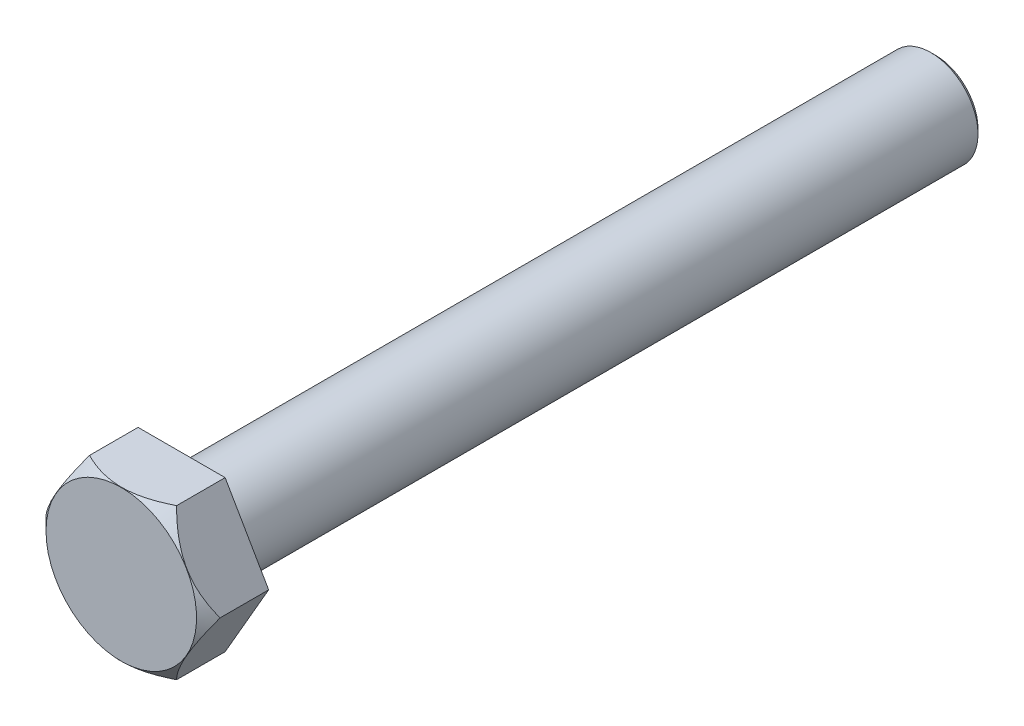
from build123d import *

# Parameters (mm, degrees)
BOSS_EXTRU_1_DEPTH = 6.4


with BuildPart() as part:
    # Esquisse1 → Boss.-Extru.1 (new body)
    with BuildSketch(Plane.XY):
        Polygon((9.237604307, 0), (4.618802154, 8), (-4.618802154, 8), (-9.237604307, 0), (-4.618802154, -8), (4.618802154, -8), align=None)
    extrude(amount=BOSS_EXTRU_1_DEPTH)

    # Esquisse3 → Enl_vement de mati_re-R_volution2 (revolve, cut)
    with BuildSketch(Plane(origin=(0, 0, 0), x_dir=(1, 0, 0), z_dir=(0, 1, 0))):
        Polygon((-9.237604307, -5.15), (-7.987604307, -6.4), (-7.987604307, -8.078189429), (-10.154335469, -8.078189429), (-10.154335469, -5.15), align=None)
    revolve(axis=Axis((0, 0, -2.903094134), (0, 0, 1)), mode=Mode.SUBTRACT)


with BuildPart() as body_2:
    # Esquisse4 → R_volution2 (revolve)
    with BuildSketch(Plane(origin=(0, 0, 0), x_dir=(0, 0, -1), z_dir=(1, 0, 0)), mode=Mode.PRIVATE) as r_volution2_sk:
        Polygon((0, -5), (79.5, -5), (80, -4.5), (80, 0), (0, 0), align=None)
    revolve(r_volution2_sk.sketch.rotate(Axis((0, 0, 0), (0, 0, -1)), 270), axis=Axis((0, 0, 0), (0, 0, -1)))


solid = Compound([part.part, body_2.part])
